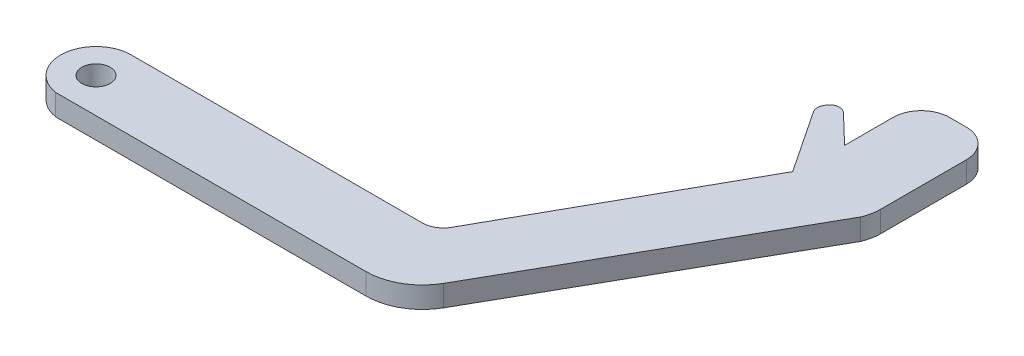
ISO-10303-21;
HEADER;
FILE_DESCRIPTION(('STEP AP214'),'2;1');
FILE_NAME('part.step','',(''),(''),'','','');
FILE_SCHEMA(('AUTOMOTIVE_DESIGN { 1 0 10303 214 1 1 1 1 }'));
ENDSEC;
DATA;
#1=APPLICATION_CONTEXT('core data for automotive mechanical design processes');
#2=APPLICATION_PROTOCOL_DEFINITION('international standard','automotive_design',2000,#1);
#3=PRODUCT_CONTEXT('',#1,'mechanical');
#4=PRODUCT('Part','Part','',(#3));
#5=PRODUCT_RELATED_PRODUCT_CATEGORY('part','',(#4));
#6=PRODUCT_DEFINITION_FORMATION('','',#4);
#7=PRODUCT_DEFINITION_CONTEXT('part definition',#1,'design');
#8=PRODUCT_DEFINITION('design','',#6,#7);
#9=PRODUCT_DEFINITION_SHAPE('','',#8);
#10=(LENGTH_UNIT() NAMED_UNIT(*) SI_UNIT(.MILLI.,.METRE.));
#11=(NAMED_UNIT(*) PLANE_ANGLE_UNIT() SI_UNIT($,.RADIAN.));
#12=(NAMED_UNIT(*) SI_UNIT($,.STERADIAN.) SOLID_ANGLE_UNIT());
#13=UNCERTAINTY_MEASURE_WITH_UNIT(LENGTH_MEASURE(1.E-05),#10,'distance_accuracy_value','');
#14=(GEOMETRIC_REPRESENTATION_CONTEXT(3) GLOBAL_UNCERTAINTY_ASSIGNED_CONTEXT((#13)) GLOBAL_UNIT_ASSIGNED_CONTEXT((#10,
#11,#12)) REPRESENTATION_CONTEXT('',''));
#15=CARTESIAN_POINT('',(0.,0.,0.));
#16=DIRECTION('',(0.,0.,1.));
#17=DIRECTION('',(1.,0.,0.));
#18=AXIS2_PLACEMENT_3D('',#15,#16,#17);
#19=CARTESIAN_POINT('',(61.8817697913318,3.,-39.0581389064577));
#20=DIRECTION('',(0.,-1.,0.));
#21=DIRECTION('',(0.,0.,-1.));
#22=AXIS2_PLACEMENT_3D('',#19,#20,#21);
#23=PLANE('',#22);
#24=CARTESIAN_POINT('',(61.8817697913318,3.,-39.0581389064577));
#25=DIRECTION('',(0.,1.,0.));
#26=DIRECTION('',(0.,0.,-1.));
#27=AXIS2_PLACEMENT_3D('',#24,#25,#26);
#28=CIRCLE('',#27,6.);
#29=CARTESIAN_POINT('',(67.4043872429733,3.,-36.7127825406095));
#30=VERTEX_POINT('',#29);
#31=CARTESIAN_POINT('',(67.8817697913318,3.,-39.0581389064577));
#32=VERTEX_POINT('',#31);
#33=EDGE_CURVE('E228',#30,#32,#28,.T.);
#34=ORIENTED_EDGE('',*,*,#33,.T.);
#35=DIRECTION('',(0.,0.,-1.));
#36=VECTOR('',#35,1.);
#37=CARTESIAN_POINT('',(67.8817697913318,3.,-44.3552725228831));
#38=LINE('',#37,#36);
#39=CARTESIAN_POINT('',(67.8817697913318,3.,-51.2044482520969));
#40=VERTEX_POINT('',#39);
#41=EDGE_CURVE('E124',#32,#40,#38,.T.);
#42=ORIENTED_EDGE('',*,*,#41,.T.);
#43=CARTESIAN_POINT('',(63.8817697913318,3.,-51.2044482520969));
#44=DIRECTION('',(0.,1.,0.));
#45=DIRECTION('',(0.,0.,-1.));
#46=AXIS2_PLACEMENT_3D('',#43,#44,#45);
#47=CIRCLE('',#46,4.);
#48=CARTESIAN_POINT('',(63.8817697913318,3.,-55.2044482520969));
#49=VERTEX_POINT('',#48);
#50=EDGE_CURVE('E273',#40,#49,#47,.T.);
#51=ORIENTED_EDGE('',*,*,#50,.T.);
#52=DIRECTION('',(-1.,0.,0.));
#53=VECTOR('',#52,1.);
#54=CARTESIAN_POINT('',(61.507958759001,3.,-55.2044482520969));
#55=LINE('',#54,#53);
#56=CARTESIAN_POINT('',(61.507958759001,3.,-55.2044482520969));
#57=VERTEX_POINT('',#56);
#58=EDGE_CURVE('E291',#49,#57,#55,.T.);
#59=ORIENTED_EDGE('',*,*,#58,.T.);
#60=CARTESIAN_POINT('',(61.507958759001,3.,-51.2044482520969));
#61=DIRECTION('',(0.,1.,0.));
#62=DIRECTION('',(0.,0.,-1.));
#63=AXIS2_PLACEMENT_3D('',#60,#61,#62);
#64=CIRCLE('',#63,4.);
#65=CARTESIAN_POINT('',(57.507958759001,3.,-51.2044482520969));
#66=VERTEX_POINT('',#65);
#67=EDGE_CURVE('E288',#57,#66,#64,.T.);
#68=ORIENTED_EDGE('',*,*,#67,.T.);
#69=DIRECTION('',(0.,0.,1.));
#70=VECTOR('',#69,1.);
#71=CARTESIAN_POINT('',(57.507958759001,3.,-48.9302342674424));
#72=LINE('',#71,#70);
#73=CARTESIAN_POINT('',(57.507958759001,3.,-44.3552725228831));
#74=VERTEX_POINT('',#73);
#75=EDGE_CURVE('E290',#66,#74,#72,.T.);
#76=ORIENTED_EDGE('',*,*,#75,.T.);
#77=DIRECTION('',(-0.720981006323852,0.,-0.692954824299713));
#78=VECTOR('',#77,1.);
#79=CARTESIAN_POINT('',(53.4285146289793,3.,-48.2761393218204));
#80=LINE('',#79,#78);
#81=CARTESIAN_POINT('',(53.4285146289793,3.,-48.2761393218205));
#82=VERTEX_POINT('',#81);
#83=EDGE_CURVE('E293',#74,#82,#80,.T.);
#84=ORIENTED_EDGE('',*,*,#83,.T.);
#85=CARTESIAN_POINT('',(52.4583778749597,3.,-47.2667659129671));
#86=DIRECTION('',(0.,1.,0.));
#87=DIRECTION('',(0.,0.,-1.));
#88=AXIS2_PLACEMENT_3D('',#85,#86,#87);
#89=CIRCLE('',#88,1.4);
#90=CARTESIAN_POINT('',(51.1937534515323,3.,-47.8673698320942));
#91=VERTEX_POINT('',#90);
#92=EDGE_CURVE('E299',#82,#91,#89,.T.);
#93=ORIENTED_EDGE('',*,*,#92,.T.);
#94=DIRECTION('',(-0.429002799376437,0.,0.903303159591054));
#95=VECTOR('',#94,1.);
#96=CARTESIAN_POINT('',(51.0905987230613,3.,-47.6501684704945));
#97=LINE('',#96,#95);
#98=CARTESIAN_POINT('',(51.0905987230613,3.,-47.6501684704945));
#99=VERTEX_POINT('',#98);
#100=EDGE_CURVE('E301',#91,#99,#97,.T.);
#101=ORIENTED_EDGE('',*,*,#100,.T.);
#102=CARTESIAN_POINT('',(52.3552231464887,3.,-47.0495645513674));
#103=DIRECTION('',(0.,1.,0.));
#104=DIRECTION('',(0.,0.,-1.));
#105=AXIS2_PLACEMENT_3D('',#102,#103,#104);
#106=CIRCLE('',#105,1.4);
#107=CARTESIAN_POINT('',(51.1900790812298,3.,-46.2733949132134));
#108=VERTEX_POINT('',#107);
#109=EDGE_CURVE('E303',#99,#108,#106,.T.);
#110=ORIENTED_EDGE('',*,*,#109,.T.);
#111=DIRECTION('',(0.554406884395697,0.,0.832245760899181));
#112=VECTOR('',#111,1.);
#113=CARTESIAN_POINT('',(57.0519286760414,3.,-37.473901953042));
#114=LINE('',#113,#112);
#115=CARTESIAN_POINT('',(57.0519286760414,3.,-37.473901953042));
#116=VERTEX_POINT('',#115);
#117=EDGE_CURVE('E305',#108,#116,#114,.T.);
#118=ORIENTED_EDGE('',*,*,#117,.T.);
#119=DIRECTION('',(-0.487903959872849,0.,0.872897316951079));
#120=VECTOR('',#119,1.);
#121=CARTESIAN_POINT('',(57.0519286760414,3.,-37.473901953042));
#122=LINE('',#121,#120);
#123=CARTESIAN_POINT('',(39.758159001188,3.,-6.53403183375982));
#124=VERTEX_POINT('',#123);
#125=EDGE_CURVE('E307',#116,#124,#122,.T.);
#126=ORIENTED_EDGE('',*,*,#125,.T.);
#127=CARTESIAN_POINT('',(37.1407294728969,3.,-8.));
#128=DIRECTION('',(0.,-1.,0.));
#129=DIRECTION('',(0.,0.,1.));
#130=AXIS2_PLACEMENT_3D('',#127,#128,#129);
#131=CIRCLE('',#130,3.);
#132=CARTESIAN_POINT('',(37.1407294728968,3.,-5.));
#133=VERTEX_POINT('',#132);
#134=EDGE_CURVE('E309',#124,#133,#131,.T.);
#135=ORIENTED_EDGE('',*,*,#134,.T.);
#136=DIRECTION('',(-1.,0.,0.));
#137=VECTOR('',#136,1.);
#138=CARTESIAN_POINT('',(3.89897948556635,3.,-5.));
#139=LINE('',#138,#137);
#140=CARTESIAN_POINT('',(-4.,3.,-5.));
#141=VERTEX_POINT('',#140);
#142=EDGE_CURVE('E311',#133,#141,#139,.T.);
#143=ORIENTED_EDGE('',*,*,#142,.T.);
#144=CARTESIAN_POINT('',(-4.,3.,0.));
#145=DIRECTION('',(0.,1.,0.));
#146=DIRECTION('',(0.,0.,1.));
#147=AXIS2_PLACEMENT_3D('',#144,#145,#146);
#148=CIRCLE('',#147,5.);
#149=CARTESIAN_POINT('',(-4.76749740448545,3.,4.94074364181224));
#150=VERTEX_POINT('',#149);
#151=EDGE_CURVE('E173',#141,#150,#148,.T.);
#152=ORIENTED_EDGE('',*,*,#151,.T.);
#153=DIRECTION('',(1.,0.,0.));
#154=VECTOR('',#153,1.);
#155=CARTESIAN_POINT('',(0.898979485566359,3.,4.94074364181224));
#156=LINE('',#155,#154);
#157=CARTESIAN_POINT('',(39.1017625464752,3.,4.94074364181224));
#158=VERTEX_POINT('',#157);
#159=EDGE_CURVE('E167',#150,#158,#156,.T.);
#160=ORIENTED_EDGE('',*,*,#159,.T.);
#161=CARTESIAN_POINT('',(39.1017625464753,3.,-3.05925635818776));
#162=DIRECTION('',(0.,1.,0.));
#163=DIRECTION('',(0.,0.,1.));
#164=AXIS2_PLACEMENT_3D('',#161,#162,#163);
#165=CIRCLE('',#164,8.);
#166=CARTESIAN_POINT('',(46.0589916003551,3.,0.890042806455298));
#167=VERTEX_POINT('',#166);
#168=EDGE_CURVE('E171',#158,#167,#165,.T.);
#169=ORIENTED_EDGE('',*,*,#168,.T.);
#170=DIRECTION('',(0.493662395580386,0.,-0.869653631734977));
#171=VECTOR('',#170,1.);
#172=CARTESIAN_POINT('',(67.4043872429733,3.,-36.7127825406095));
#173=LINE('',#172,#171);
#174=EDGE_CURVE('E51',#167,#30,#173,.T.);
#175=ORIENTED_EDGE('',*,*,#174,.T.);
#176=EDGE_LOOP('',(#34,#42,#51,#59,#68,#76,#84,#93,#101,#110,#118,#126,#135,#143,#152,#160,#169,#175));
#177=FACE_BOUND('',#176,.T.);
#178=CARTESIAN_POINT('',(-4.,3.,0.));
#179=DIRECTION('',(0.,1.,0.));
#180=DIRECTION('',(0.,0.,1.));
#181=AXIS2_PLACEMENT_3D('',#178,#179,#180);
#182=CIRCLE('',#181,2.);
#183=CARTESIAN_POINT('',(-4.,3.,2.));
#184=VERTEX_POINT('',#183);
#185=EDGE_CURVE('E194',#184,#184,#182,.T.);
#186=ORIENTED_EDGE('',*,*,#185,.F.);
#187=EDGE_LOOP('',(#186));
#188=FACE_BOUND('',#187,.T.);
#189=ADVANCED_FACE('F34',(#177,#188),#23,.F.);
#190=CARTESIAN_POINT('',(61.8817697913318,0.,-39.0581389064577));
#191=DIRECTION('',(0.,-1.,0.));
#192=DIRECTION('',(0.,0.,-1.));
#193=AXIS2_PLACEMENT_3D('',#190,#191,#192);
#194=PLANE('',#193);
#195=CARTESIAN_POINT('',(61.8817697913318,0.,-39.0581389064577));
#196=DIRECTION('',(0.,1.,0.));
#197=DIRECTION('',(0.,0.,-1.));
#198=AXIS2_PLACEMENT_3D('',#195,#196,#197);
#199=CIRCLE('',#198,6.);
#200=CARTESIAN_POINT('',(67.4043872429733,0.,-36.7127825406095));
#201=VERTEX_POINT('',#200);
#202=CARTESIAN_POINT('',(67.8817697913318,0.,-39.0581389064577));
#203=VERTEX_POINT('',#202);
#204=EDGE_CURVE('E190',#201,#203,#199,.T.);
#205=ORIENTED_EDGE('',*,*,#204,.F.);
#206=DIRECTION('',(0.493662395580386,0.,-0.869653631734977));
#207=VECTOR('',#206,1.);
#208=CARTESIAN_POINT('',(67.4043872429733,0.,-36.7127825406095));
#209=LINE('',#208,#207);
#210=CARTESIAN_POINT('',(46.0589916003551,0.,0.890042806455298));
#211=VERTEX_POINT('',#210);
#212=EDGE_CURVE('E116',#211,#201,#209,.T.);
#213=ORIENTED_EDGE('',*,*,#212,.F.);
#214=CARTESIAN_POINT('',(39.1017625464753,0.,-3.05925635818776));
#215=DIRECTION('',(0.,1.,0.));
#216=DIRECTION('',(0.,0.,1.));
#217=AXIS2_PLACEMENT_3D('',#214,#215,#216);
#218=CIRCLE('',#217,8.);
#219=CARTESIAN_POINT('',(39.1017625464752,0.,4.94074364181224));
#220=VERTEX_POINT('',#219);
#221=EDGE_CURVE('E110',#220,#211,#218,.T.);
#222=ORIENTED_EDGE('',*,*,#221,.F.);
#223=DIRECTION('',(1.,0.,0.));
#224=VECTOR('',#223,1.);
#225=CARTESIAN_POINT('',(3.89897948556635,0.,4.94074364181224));
#226=LINE('',#225,#224);
#227=CARTESIAN_POINT('',(-4.76749740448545,0.,4.94074364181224));
#228=VERTEX_POINT('',#227);
#229=EDGE_CURVE('E180',#228,#220,#226,.T.);
#230=ORIENTED_EDGE('',*,*,#229,.F.);
#231=CARTESIAN_POINT('',(-4.,0.,0.));
#232=DIRECTION('',(0.,1.,0.));
#233=DIRECTION('',(0.,0.,1.));
#234=AXIS2_PLACEMENT_3D('',#231,#232,#233);
#235=CIRCLE('',#234,5.);
#236=CARTESIAN_POINT('',(-4.,0.,-5.));
#237=VERTEX_POINT('',#236);
#238=EDGE_CURVE('E222',#237,#228,#235,.T.);
#239=ORIENTED_EDGE('',*,*,#238,.F.);
#240=DIRECTION('',(-1.,0.,0.));
#241=VECTOR('',#240,1.);
#242=CARTESIAN_POINT('',(0.898979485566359,0.,-5.));
#243=LINE('',#242,#241);
#244=CARTESIAN_POINT('',(37.1407294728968,0.,-5.));
#245=VERTEX_POINT('',#244);
#246=EDGE_CURVE('E220',#245,#237,#243,.T.);
#247=ORIENTED_EDGE('',*,*,#246,.F.);
#248=CARTESIAN_POINT('',(37.1407294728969,0.,-8.));
#249=DIRECTION('',(0.,-1.,0.));
#250=DIRECTION('',(0.,0.,1.));
#251=AXIS2_PLACEMENT_3D('',#248,#249,#250);
#252=CIRCLE('',#251,3.);
#253=CARTESIAN_POINT('',(39.758159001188,0.,-6.53403183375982));
#254=VERTEX_POINT('',#253);
#255=EDGE_CURVE('E217',#254,#245,#252,.T.);
#256=ORIENTED_EDGE('',*,*,#255,.F.);
#257=DIRECTION('',(-0.487903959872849,0.,0.872897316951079));
#258=VECTOR('',#257,1.);
#259=CARTESIAN_POINT('',(57.0519286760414,0.,-37.473901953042));
#260=LINE('',#259,#258);
#261=CARTESIAN_POINT('',(57.0519286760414,0.,-37.473901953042));
#262=VERTEX_POINT('',#261);
#263=EDGE_CURVE('E215',#262,#254,#260,.T.);
#264=ORIENTED_EDGE('',*,*,#263,.F.);
#265=DIRECTION('',(0.554406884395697,0.,0.832245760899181));
#266=VECTOR('',#265,1.);
#267=CARTESIAN_POINT('',(57.0519286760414,0.,-37.473901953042));
#268=LINE('',#267,#266);
#269=CARTESIAN_POINT('',(51.1900790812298,0.,-46.2733949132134));
#270=VERTEX_POINT('',#269);
#271=EDGE_CURVE('E213',#270,#262,#268,.T.);
#272=ORIENTED_EDGE('',*,*,#271,.F.);
#273=CARTESIAN_POINT('',(52.3552231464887,0.,-47.0495645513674));
#274=DIRECTION('',(0.,1.,0.));
#275=DIRECTION('',(0.,0.,-1.));
#276=AXIS2_PLACEMENT_3D('',#273,#274,#275);
#277=CIRCLE('',#276,1.4);
#278=CARTESIAN_POINT('',(51.0905987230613,0.,-47.6501684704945));
#279=VERTEX_POINT('',#278);
#280=EDGE_CURVE('E211',#279,#270,#277,.T.);
#281=ORIENTED_EDGE('',*,*,#280,.F.);
#282=DIRECTION('',(-0.429002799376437,0.,0.903303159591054));
#283=VECTOR('',#282,1.);
#284=CARTESIAN_POINT('',(51.0905987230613,0.,-47.6501684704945));
#285=LINE('',#284,#283);
#286=CARTESIAN_POINT('',(51.1937534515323,0.,-47.8673698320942));
#287=VERTEX_POINT('',#286);
#288=EDGE_CURVE('E209',#287,#279,#285,.T.);
#289=ORIENTED_EDGE('',*,*,#288,.F.);
#290=CARTESIAN_POINT('',(52.4583778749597,0.,-47.2667659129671));
#291=DIRECTION('',(0.,1.,0.));
#292=DIRECTION('',(0.,0.,-1.));
#293=AXIS2_PLACEMENT_3D('',#290,#291,#292);
#294=CIRCLE('',#293,1.4);
#295=CARTESIAN_POINT('',(53.4285146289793,0.,-48.2761393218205));
#296=VERTEX_POINT('',#295);
#297=EDGE_CURVE('E207',#296,#287,#294,.T.);
#298=ORIENTED_EDGE('',*,*,#297,.F.);
#299=DIRECTION('',(-0.720981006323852,0.,-0.692954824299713));
#300=VECTOR('',#299,1.);
#301=CARTESIAN_POINT('',(53.4285146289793,0.,-48.2761393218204));
#302=LINE('',#301,#300);
#303=CARTESIAN_POINT('',(57.507958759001,0.,-44.3552725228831));
#304=VERTEX_POINT('',#303);
#305=EDGE_CURVE('E205',#304,#296,#302,.T.);
#306=ORIENTED_EDGE('',*,*,#305,.F.);
#307=DIRECTION('',(0.,0.,1.));
#308=VECTOR('',#307,1.);
#309=CARTESIAN_POINT('',(57.507958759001,0.,-44.3552725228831));
#310=LINE('',#309,#308);
#311=CARTESIAN_POINT('',(57.507958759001,0.,-51.2044482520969));
#312=VERTEX_POINT('',#311);
#313=EDGE_CURVE('E203',#312,#304,#310,.T.);
#314=ORIENTED_EDGE('',*,*,#313,.F.);
#315=CARTESIAN_POINT('',(61.507958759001,0.,-51.2044482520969));
#316=DIRECTION('',(0.,1.,0.));
#317=DIRECTION('',(0.,0.,-1.));
#318=AXIS2_PLACEMENT_3D('',#315,#316,#317);
#319=CIRCLE('',#318,4.);
#320=CARTESIAN_POINT('',(61.507958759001,0.,-55.2044482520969));
#321=VERTEX_POINT('',#320);
#322=EDGE_CURVE('E200',#321,#312,#319,.T.);
#323=ORIENTED_EDGE('',*,*,#322,.F.);
#324=DIRECTION('',(-1.,0.,0.));
#325=VECTOR('',#324,1.);
#326=CARTESIAN_POINT('',(61.507958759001,0.,-55.2044482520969));
#327=LINE('',#326,#325);
#328=CARTESIAN_POINT('',(63.8817697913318,0.,-55.2044482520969));
#329=VERTEX_POINT('',#328);
#330=EDGE_CURVE('E198',#329,#321,#327,.T.);
#331=ORIENTED_EDGE('',*,*,#330,.F.);
#332=CARTESIAN_POINT('',(63.8817697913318,0.,-51.2044482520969));
#333=DIRECTION('',(0.,1.,0.));
#334=DIRECTION('',(0.,0.,-1.));
#335=AXIS2_PLACEMENT_3D('',#332,#333,#334);
#336=CIRCLE('',#335,4.);
#337=CARTESIAN_POINT('',(67.8817697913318,0.,-51.2044482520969));
#338=VERTEX_POINT('',#337);
#339=EDGE_CURVE('E196',#338,#329,#336,.T.);
#340=ORIENTED_EDGE('',*,*,#339,.F.);
#341=DIRECTION('',(0.,0.,-1.));
#342=VECTOR('',#341,1.);
#343=CARTESIAN_POINT('',(67.8817697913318,0.,-51.2044482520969));
#344=LINE('',#343,#342);
#345=EDGE_CURVE('E193',#203,#338,#344,.T.);
#346=ORIENTED_EDGE('',*,*,#345,.F.);
#347=EDGE_LOOP('',(#205,#213,#222,#230,#239,#247,#256,#264,#272,#281,#289,#298,#306,#314,#323,
#331,#340,#346));
#348=FACE_BOUND('',#347,.T.);
#349=CARTESIAN_POINT('',(-4.,0.,0.));
#350=DIRECTION('',(0.,1.,0.));
#351=DIRECTION('',(0.,0.,1.));
#352=AXIS2_PLACEMENT_3D('',#349,#350,#351);
#353=CIRCLE('',#352,2.);
#354=CARTESIAN_POINT('',(-4.,0.,2.));
#355=VERTEX_POINT('',#354);
#356=EDGE_CURVE('E591',#355,#355,#353,.T.);
#357=ORIENTED_EDGE('',*,*,#356,.T.);
#358=EDGE_LOOP('',(#357));
#359=FACE_BOUND('',#358,.T.);
#360=ADVANCED_FACE('F277',(#348,#359),#194,.T.);
#361=CARTESIAN_POINT('',(61.8817697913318,3.,-39.0581389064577));
#362=DIRECTION('',(0.,-1.,0.));
#363=DIRECTION('',(0.,0.,-1.));
#364=AXIS2_PLACEMENT_3D('',#361,#362,#363);
#365=CYLINDRICAL_SURFACE('',#364,6.);
#366=ORIENTED_EDGE('',*,*,#204,.T.);
#367=DIRECTION('',(0.,-1.,0.));
#368=VECTOR('',#367,1.);
#369=CARTESIAN_POINT('',(67.8817697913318,3.,-39.0581389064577));
#370=LINE('',#369,#368);
#371=EDGE_CURVE('E11',#32,#203,#370,.T.);
#372=ORIENTED_EDGE('',*,*,#371,.F.);
#373=ORIENTED_EDGE('',*,*,#33,.F.);
#374=DIRECTION('',(0.,-1.,0.));
#375=VECTOR('',#374,1.);
#376=CARTESIAN_POINT('',(67.4043872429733,3.,-36.7127825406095));
#377=LINE('',#376,#375);
#378=EDGE_CURVE('E186',#30,#201,#377,.T.);
#379=ORIENTED_EDGE('',*,*,#378,.T.);
#380=EDGE_LOOP('',(#366,#372,#373,#379));
#381=FACE_BOUND('',#380,.T.);
#382=ADVANCED_FACE('F36',(#381),#365,.T.);
#383=CARTESIAN_POINT('',(67.8817697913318,3.,-51.2044482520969));
#384=DIRECTION('',(-1.,0.,0.));
#385=DIRECTION('',(0.,0.,1.));
#386=AXIS2_PLACEMENT_3D('',#383,#384,#385);
#387=PLANE('',#386);
#388=ORIENTED_EDGE('',*,*,#345,.T.);
#389=DIRECTION('',(0.,-1.,0.));
#390=VECTOR('',#389,1.);
#391=CARTESIAN_POINT('',(67.8817697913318,3.,-51.2044482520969));
#392=LINE('',#391,#390);
#393=EDGE_CURVE('E43',#40,#338,#392,.T.);
#394=ORIENTED_EDGE('',*,*,#393,.F.);
#395=ORIENTED_EDGE('',*,*,#41,.F.);
#396=ORIENTED_EDGE('',*,*,#371,.T.);
#397=EDGE_LOOP('',(#388,#394,#395,#396));
#398=FACE_BOUND('',#397,.T.);
#399=ADVANCED_FACE('F345',(#398),#387,.F.);
#400=CARTESIAN_POINT('',(63.8817697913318,3.,-51.2044482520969));
#401=DIRECTION('',(0.,-1.,0.));
#402=DIRECTION('',(0.,0.,-1.));
#403=AXIS2_PLACEMENT_3D('',#400,#401,#402);
#404=CYLINDRICAL_SURFACE('',#403,4.);
#405=ORIENTED_EDGE('',*,*,#339,.T.);
#406=DIRECTION('',(0.,-1.,0.));
#407=VECTOR('',#406,1.);
#408=CARTESIAN_POINT('',(63.8817697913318,3.,-55.2044482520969));
#409=LINE('',#408,#407);
#410=EDGE_CURVE('E265',#49,#329,#409,.T.);
#411=ORIENTED_EDGE('',*,*,#410,.F.);
#412=ORIENTED_EDGE('',*,*,#50,.F.);
#413=ORIENTED_EDGE('',*,*,#393,.T.);
#414=EDGE_LOOP('',(#405,#411,#412,#413));
#415=FACE_BOUND('',#414,.T.);
#416=ADVANCED_FACE('F271',(#415),#404,.T.);
#417=CARTESIAN_POINT('',(61.507958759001,3.,-55.2044482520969));
#418=DIRECTION('',(0.,0.,1.));
#419=DIRECTION('',(1.,0.,0.));
#420=AXIS2_PLACEMENT_3D('',#417,#418,#419);
#421=PLANE('',#420);
#422=ORIENTED_EDGE('',*,*,#330,.T.);
#423=DIRECTION('',(0.,-1.,0.));
#424=VECTOR('',#423,1.);
#425=CARTESIAN_POINT('',(61.507958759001,3.,-55.2044482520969));
#426=LINE('',#425,#424);
#427=EDGE_CURVE('E262',#57,#321,#426,.T.);
#428=ORIENTED_EDGE('',*,*,#427,.F.);
#429=ORIENTED_EDGE('',*,*,#58,.F.);
#430=ORIENTED_EDGE('',*,*,#410,.T.);
#431=EDGE_LOOP('',(#422,#428,#429,#430));
#432=FACE_BOUND('',#431,.T.);
#433=ADVANCED_FACE('F282',(#432),#421,.F.);
#434=CARTESIAN_POINT('',(61.507958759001,3.,-51.2044482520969));
#435=DIRECTION('',(0.,-1.,0.));
#436=DIRECTION('',(0.,0.,-1.));
#437=AXIS2_PLACEMENT_3D('',#434,#435,#436);
#438=CYLINDRICAL_SURFACE('',#437,4.);
#439=ORIENTED_EDGE('',*,*,#322,.T.);
#440=DIRECTION('',(0.,-1.,0.));
#441=VECTOR('',#440,1.);
#442=CARTESIAN_POINT('',(57.507958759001,3.,-51.2044482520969));
#443=LINE('',#442,#441);
#444=EDGE_CURVE('E259',#66,#312,#443,.T.);
#445=ORIENTED_EDGE('',*,*,#444,.F.);
#446=ORIENTED_EDGE('',*,*,#67,.F.);
#447=ORIENTED_EDGE('',*,*,#427,.T.);
#448=EDGE_LOOP('',(#439,#445,#446,#447));
#449=FACE_BOUND('',#448,.T.);
#450=ADVANCED_FACE('F286',(#449),#438,.T.);
#451=CARTESIAN_POINT('',(57.507958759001,3.,-44.3552725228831));
#452=DIRECTION('',(1.,0.,0.));
#453=DIRECTION('',(0.,0.,-1.));
#454=AXIS2_PLACEMENT_3D('',#451,#452,#453);
#455=PLANE('',#454);
#456=ORIENTED_EDGE('',*,*,#313,.T.);
#457=DIRECTION('',(0.,-1.,0.));
#458=VECTOR('',#457,1.);
#459=CARTESIAN_POINT('',(57.507958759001,3.,-44.3552725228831));
#460=LINE('',#459,#458);
#461=EDGE_CURVE('E256',#74,#304,#460,.T.);
#462=ORIENTED_EDGE('',*,*,#461,.F.);
#463=ORIENTED_EDGE('',*,*,#75,.F.);
#464=ORIENTED_EDGE('',*,*,#444,.T.);
#465=EDGE_LOOP('',(#456,#462,#463,#464));
#466=FACE_BOUND('',#465,.T.);
#467=ADVANCED_FACE('F358',(#466),#455,.F.);
#468=CARTESIAN_POINT('',(53.4285146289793,3.,-48.2761393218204));
#469=DIRECTION('',(-0.692954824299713,0.,0.720981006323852));
#470=DIRECTION('',(0.720981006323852,0.,0.692954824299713));
#471=AXIS2_PLACEMENT_3D('',#468,#469,#470);
#472=PLANE('',#471);
#473=ORIENTED_EDGE('',*,*,#305,.T.);
#474=DIRECTION('',(0.,-1.,0.));
#475=VECTOR('',#474,1.);
#476=CARTESIAN_POINT('',(53.4285146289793,3.,-48.2761393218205));
#477=LINE('',#476,#475);
#478=EDGE_CURVE('E253',#82,#296,#477,.T.);
#479=ORIENTED_EDGE('',*,*,#478,.F.);
#480=ORIENTED_EDGE('',*,*,#83,.F.);
#481=ORIENTED_EDGE('',*,*,#461,.T.);
#482=EDGE_LOOP('',(#473,#479,#480,#481));
#483=FACE_BOUND('',#482,.T.);
#484=ADVANCED_FACE('F361',(#483),#472,.F.);
#485=CARTESIAN_POINT('',(52.4583778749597,3.,-47.2667659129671));
#486=DIRECTION('',(0.,-1.,0.));
#487=DIRECTION('',(0.,0.,-1.));
#488=AXIS2_PLACEMENT_3D('',#485,#486,#487);
#489=CYLINDRICAL_SURFACE('',#488,1.4);
#490=ORIENTED_EDGE('',*,*,#297,.T.);
#491=DIRECTION('',(0.,-1.,0.));
#492=VECTOR('',#491,1.);
#493=CARTESIAN_POINT('',(51.1937534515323,3.,-47.8673698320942));
#494=LINE('',#493,#492);
#495=EDGE_CURVE('E250',#91,#287,#494,.T.);
#496=ORIENTED_EDGE('',*,*,#495,.F.);
#497=ORIENTED_EDGE('',*,*,#92,.F.);
#498=ORIENTED_EDGE('',*,*,#478,.T.);
#499=EDGE_LOOP('',(#490,#496,#497,#498));
#500=FACE_BOUND('',#499,.T.);
#501=ADVANCED_FACE('F365',(#500),#489,.T.);
#502=CARTESIAN_POINT('',(51.0905987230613,3.,-47.6501684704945));
#503=DIRECTION('',(0.903303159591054,0.,0.429002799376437));
#504=DIRECTION('',(0.429002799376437,0.,-0.903303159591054));
#505=AXIS2_PLACEMENT_3D('',#502,#503,#504);
#506=PLANE('',#505);
#507=ORIENTED_EDGE('',*,*,#288,.T.);
#508=DIRECTION('',(0.,-1.,0.));
#509=VECTOR('',#508,1.);
#510=CARTESIAN_POINT('',(51.0905987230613,3.,-47.6501684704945));
#511=LINE('',#510,#509);
#512=EDGE_CURVE('E247',#99,#279,#511,.T.);
#513=ORIENTED_EDGE('',*,*,#512,.F.);
#514=ORIENTED_EDGE('',*,*,#100,.F.);
#515=ORIENTED_EDGE('',*,*,#495,.T.);
#516=EDGE_LOOP('',(#507,#513,#514,#515));
#517=FACE_BOUND('',#516,.T.);
#518=ADVANCED_FACE('F369',(#517),#506,.F.);
#519=CARTESIAN_POINT('',(52.3552231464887,3.,-47.0495645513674));
#520=DIRECTION('',(0.,-1.,0.));
#521=DIRECTION('',(0.,0.,-1.));
#522=AXIS2_PLACEMENT_3D('',#519,#520,#521);
#523=CYLINDRICAL_SURFACE('',#522,1.4);
#524=ORIENTED_EDGE('',*,*,#280,.T.);
#525=DIRECTION('',(0.,-1.,0.));
#526=VECTOR('',#525,1.);
#527=CARTESIAN_POINT('',(51.1900790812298,3.,-46.2733949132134));
#528=LINE('',#527,#526);
#529=EDGE_CURVE('E244',#108,#270,#528,.T.);
#530=ORIENTED_EDGE('',*,*,#529,.F.);
#531=ORIENTED_EDGE('',*,*,#109,.F.);
#532=ORIENTED_EDGE('',*,*,#512,.T.);
#533=EDGE_LOOP('',(#524,#530,#531,#532));
#534=FACE_BOUND('',#533,.T.);
#535=ADVANCED_FACE('F373',(#534),#523,.T.);
#536=CARTESIAN_POINT('',(57.0519286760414,3.,-37.473901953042));
#537=DIRECTION('',(0.832245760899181,0.,-0.554406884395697));
#538=DIRECTION('',(-0.554406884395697,0.,-0.832245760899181));
#539=AXIS2_PLACEMENT_3D('',#536,#537,#538);
#540=PLANE('',#539);
#541=ORIENTED_EDGE('',*,*,#271,.T.);
#542=DIRECTION('',(0.,-1.,0.));
#543=VECTOR('',#542,1.);
#544=CARTESIAN_POINT('',(57.0519286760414,3.,-37.473901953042));
#545=LINE('',#544,#543);
#546=EDGE_CURVE('E241',#116,#262,#545,.T.);
#547=ORIENTED_EDGE('',*,*,#546,.F.);
#548=ORIENTED_EDGE('',*,*,#117,.F.);
#549=ORIENTED_EDGE('',*,*,#529,.T.);
#550=EDGE_LOOP('',(#541,#547,#548,#549));
#551=FACE_BOUND('',#550,.T.);
#552=ADVANCED_FACE('F377',(#551),#540,.F.);
#553=CARTESIAN_POINT('',(57.0519286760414,3.,-37.473901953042));
#554=DIRECTION('',(0.872897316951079,0.,0.487903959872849));
#555=DIRECTION('',(0.487903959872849,0.,-0.872897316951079));
#556=AXIS2_PLACEMENT_3D('',#553,#554,#555);
#557=PLANE('',#556);
#558=ORIENTED_EDGE('',*,*,#263,.T.);
#559=DIRECTION('',(0.,-1.,0.));
#560=VECTOR('',#559,1.);
#561=CARTESIAN_POINT('',(39.758159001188,3.,-6.53403183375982));
#562=LINE('',#561,#560);
#563=EDGE_CURVE('E238',#124,#254,#562,.T.);
#564=ORIENTED_EDGE('',*,*,#563,.F.);
#565=ORIENTED_EDGE('',*,*,#125,.F.);
#566=ORIENTED_EDGE('',*,*,#546,.T.);
#567=EDGE_LOOP('',(#558,#564,#565,#566));
#568=FACE_BOUND('',#567,.T.);
#569=ADVANCED_FACE('F381',(#568),#557,.F.);
#570=CARTESIAN_POINT('',(37.1407294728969,3.,-8.));
#571=DIRECTION('',(0.,-1.,0.));
#572=DIRECTION('',(0.,0.,-1.));
#573=AXIS2_PLACEMENT_3D('',#570,#571,#572);
#574=CYLINDRICAL_SURFACE('',#573,3.);
#575=ORIENTED_EDGE('',*,*,#255,.T.);
#576=DIRECTION('',(0.,-1.,0.));
#577=VECTOR('',#576,1.);
#578=CARTESIAN_POINT('',(37.1407294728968,3.,-5.));
#579=LINE('',#578,#577);
#580=EDGE_CURVE('E235',#133,#245,#579,.T.);
#581=ORIENTED_EDGE('',*,*,#580,.F.);
#582=ORIENTED_EDGE('',*,*,#134,.F.);
#583=ORIENTED_EDGE('',*,*,#563,.T.);
#584=EDGE_LOOP('',(#575,#581,#582,#583));
#585=FACE_BOUND('',#584,.T.);
#586=ADVANCED_FACE('F385',(#585),#574,.F.);
#587=CARTESIAN_POINT('',(0.898979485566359,3.,-5.));
#588=DIRECTION('',(0.,0.,1.));
#589=DIRECTION('',(1.,0.,0.));
#590=AXIS2_PLACEMENT_3D('',#587,#588,#589);
#591=PLANE('',#590);
#592=ORIENTED_EDGE('',*,*,#246,.T.);
#593=DIRECTION('',(0.,-1.,0.));
#594=VECTOR('',#593,1.);
#595=CARTESIAN_POINT('',(-4.,3.,-5.));
#596=LINE('',#595,#594);
#597=EDGE_CURVE('E232',#141,#237,#596,.T.);
#598=ORIENTED_EDGE('',*,*,#597,.F.);
#599=ORIENTED_EDGE('',*,*,#142,.F.);
#600=ORIENTED_EDGE('',*,*,#580,.T.);
#601=EDGE_LOOP('',(#592,#598,#599,#600));
#602=FACE_BOUND('',#601,.T.);
#603=ADVANCED_FACE('F317',(#602),#591,.F.);
#604=CARTESIAN_POINT('',(-4.,3.,0.));
#605=DIRECTION('',(0.,-1.,0.));
#606=DIRECTION('',(0.,0.,-1.));
#607=AXIS2_PLACEMENT_3D('',#604,#605,#606);
#608=CYLINDRICAL_SURFACE('',#607,5.);
#609=ORIENTED_EDGE('',*,*,#238,.T.);
#610=DIRECTION('',(0.,-1.,0.));
#611=VECTOR('',#610,1.);
#612=CARTESIAN_POINT('',(-4.76749740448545,3.,4.94074364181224));
#613=LINE('',#612,#611);
#614=EDGE_CURVE('E181',#150,#228,#613,.T.);
#615=ORIENTED_EDGE('',*,*,#614,.F.);
#616=ORIENTED_EDGE('',*,*,#151,.F.);
#617=ORIENTED_EDGE('',*,*,#597,.T.);
#618=EDGE_LOOP('',(#609,#615,#616,#617));
#619=FACE_BOUND('',#618,.T.);
#620=ADVANCED_FACE('F320',(#619),#608,.T.);
#621=CARTESIAN_POINT('',(3.89897948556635,3.,4.94074364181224));
#622=DIRECTION('',(0.,0.,-1.));
#623=DIRECTION('',(-1.,0.,0.));
#624=AXIS2_PLACEMENT_3D('',#621,#622,#623);
#625=PLANE('',#624);
#626=ORIENTED_EDGE('',*,*,#229,.T.);
#627=DIRECTION('',(0.,-1.,0.));
#628=VECTOR('',#627,1.);
#629=CARTESIAN_POINT('',(39.1017625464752,3.,4.94074364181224));
#630=LINE('',#629,#628);
#631=EDGE_CURVE('E178',#158,#220,#630,.T.);
#632=ORIENTED_EDGE('',*,*,#631,.F.);
#633=ORIENTED_EDGE('',*,*,#159,.F.);
#634=ORIENTED_EDGE('',*,*,#614,.T.);
#635=EDGE_LOOP('',(#626,#632,#633,#634));
#636=FACE_BOUND('',#635,.T.);
#637=ADVANCED_FACE('F179',(#636),#625,.F.);
#638=CARTESIAN_POINT('',(39.1017625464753,3.,-3.05925635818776));
#639=DIRECTION('',(0.,-1.,0.));
#640=DIRECTION('',(0.,0.,-1.));
#641=AXIS2_PLACEMENT_3D('',#638,#639,#640);
#642=CYLINDRICAL_SURFACE('',#641,8.);
#643=ORIENTED_EDGE('',*,*,#221,.T.);
#644=DIRECTION('',(0.,-1.,0.));
#645=VECTOR('',#644,1.);
#646=CARTESIAN_POINT('',(46.0589916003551,3.,0.890042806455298));
#647=LINE('',#646,#645);
#648=EDGE_CURVE('E182',#167,#211,#647,.T.);
#649=ORIENTED_EDGE('',*,*,#648,.F.);
#650=ORIENTED_EDGE('',*,*,#168,.F.);
#651=ORIENTED_EDGE('',*,*,#631,.T.);
#652=EDGE_LOOP('',(#643,#649,#650,#651));
#653=FACE_BOUND('',#652,.T.);
#654=ADVANCED_FACE('F184',(#653),#642,.T.);
#655=CARTESIAN_POINT('',(67.4043872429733,3.,-36.7127825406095));
#656=DIRECTION('',(-0.869653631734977,0.,-0.493662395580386));
#657=DIRECTION('',(-0.493662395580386,0.,0.869653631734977));
#658=AXIS2_PLACEMENT_3D('',#655,#656,#657);
#659=PLANE('',#658);
#660=ORIENTED_EDGE('',*,*,#212,.T.);
#661=ORIENTED_EDGE('',*,*,#378,.F.);
#662=ORIENTED_EDGE('',*,*,#174,.F.);
#663=ORIENTED_EDGE('',*,*,#648,.T.);
#664=EDGE_LOOP('',(#660,#661,#662,#663));
#665=FACE_BOUND('',#664,.T.);
#666=ADVANCED_FACE('F325',(#665),#659,.F.);
#667=CARTESIAN_POINT('',(-4.,3.,0.));
#668=DIRECTION('',(0.,-1.,0.));
#669=DIRECTION('',(0.,0.,-1.));
#670=AXIS2_PLACEMENT_3D('',#667,#668,#669);
#671=CYLINDRICAL_SURFACE('',#670,2.);
#672=ORIENTED_EDGE('',*,*,#185,.T.);
#673=EDGE_LOOP('',(#672));
#674=FACE_BOUND('',#673,.T.);
#675=ORIENTED_EDGE('',*,*,#356,.F.);
#676=EDGE_LOOP('',(#675));
#677=FACE_BOUND('',#676,.T.);
#678=ADVANCED_FACE('F327',(#674,#677),#671,.F.);
#679=CLOSED_SHELL('',(#189,#360,#382,#399,#416,#433,#450,#467,#484,#501,#518,#535,#552,#569,
#586,#603,#620,#637,#654,#666,#678));
#680=MANIFOLD_SOLID_BREP('B2',#679);
#681=ADVANCED_BREP_SHAPE_REPRESENTATION('',(#18,#680),#14);
#682=SHAPE_DEFINITION_REPRESENTATION(#9,#681);
ENDSEC;
END-ISO-10303-21;
